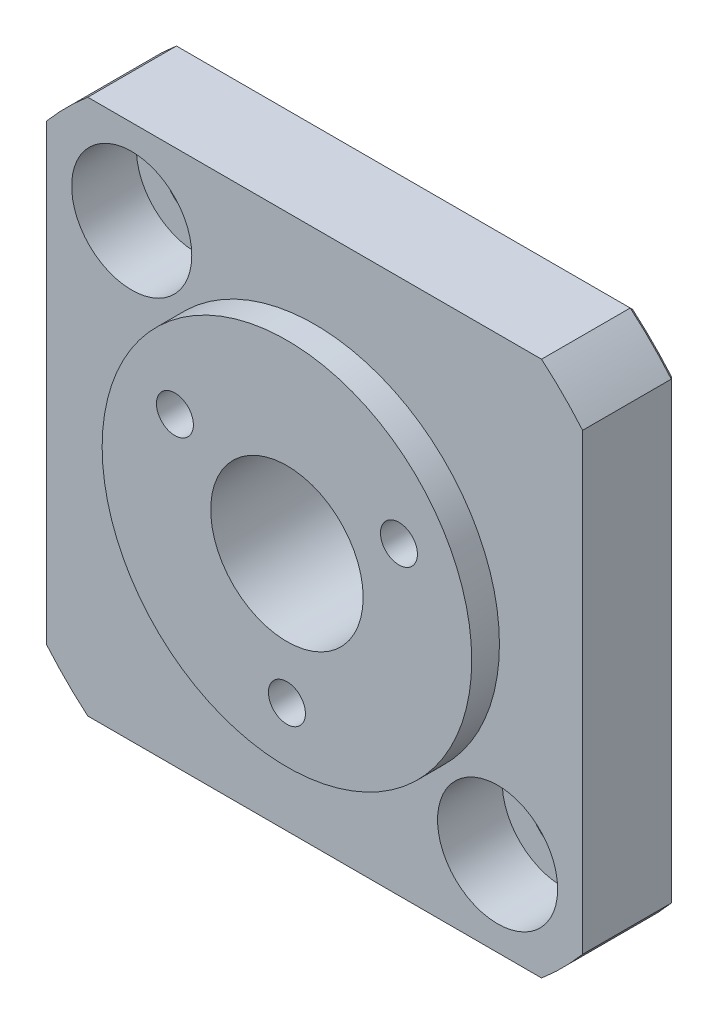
ISO-10303-21;
HEADER;
FILE_DESCRIPTION(('STEP AP214'),'2;1');
FILE_NAME('part.step','',(''),(''),'','','');
FILE_SCHEMA(('AUTOMOTIVE_DESIGN { 1 0 10303 214 1 1 1 1 }'));
ENDSEC;
DATA;
#1=APPLICATION_CONTEXT('core data for automotive mechanical design processes');
#2=APPLICATION_PROTOCOL_DEFINITION('international standard','automotive_design',2000,#1);
#3=PRODUCT_CONTEXT('',#1,'mechanical');
#4=PRODUCT('Part','Part','',(#3));
#5=PRODUCT_RELATED_PRODUCT_CATEGORY('part','',(#4));
#6=PRODUCT_DEFINITION_FORMATION('','',#4);
#7=PRODUCT_DEFINITION_CONTEXT('part definition',#1,'design');
#8=PRODUCT_DEFINITION('design','',#6,#7);
#9=PRODUCT_DEFINITION_SHAPE('','',#8);
#10=(LENGTH_UNIT() NAMED_UNIT(*) SI_UNIT(.MILLI.,.METRE.));
#11=(NAMED_UNIT(*) PLANE_ANGLE_UNIT() SI_UNIT($,.RADIAN.));
#12=(NAMED_UNIT(*) SI_UNIT($,.STERADIAN.) SOLID_ANGLE_UNIT());
#13=UNCERTAINTY_MEASURE_WITH_UNIT(LENGTH_MEASURE(1.E-05),#10,'distance_accuracy_value','');
#14=(GEOMETRIC_REPRESENTATION_CONTEXT(3) GLOBAL_UNCERTAINTY_ASSIGNED_CONTEXT((#13)) GLOBAL_UNIT_ASSIGNED_CONTEXT((#10,
#11,#12)) REPRESENTATION_CONTEXT('',''));
#15=CARTESIAN_POINT('',(0.,0.,0.));
#16=DIRECTION('',(0.,0.,1.));
#17=DIRECTION('',(1.,0.,0.));
#18=AXIS2_PLACEMENT_3D('',#15,#16,#17);
#19=CARTESIAN_POINT('',(9.9,-9.9,0.));
#20=DIRECTION('',(0.,0.,1.));
#21=DIRECTION('',(1.,0.,0.));
#22=AXIS2_PLACEMENT_3D('',#19,#20,#21);
#23=CYLINDRICAL_SURFACE('',#22,1.75);
#24=CARTESIAN_POINT('',(9.9,-9.9,0.));
#25=DIRECTION('',(0.,0.,1.));
#26=DIRECTION('',(1.,0.,0.));
#27=AXIS2_PLACEMENT_3D('',#24,#25,#26);
#28=CIRCLE('',#27,1.75);
#29=CARTESIAN_POINT('',(11.65,-9.9,0.));
#30=VERTEX_POINT('',#29);
#31=EDGE_CURVE('E608',#30,#30,#28,.T.);
#32=ORIENTED_EDGE('',*,*,#31,.F.);
#33=EDGE_LOOP('',(#32));
#34=FACE_BOUND('',#33,.T.);
#35=CARTESIAN_POINT('',(9.9,-9.9,1.5));
#36=DIRECTION('',(0.,0.,1.));
#37=DIRECTION('',(1.,0.,0.));
#38=AXIS2_PLACEMENT_3D('',#35,#36,#37);
#39=CIRCLE('',#38,1.75);
#40=CARTESIAN_POINT('',(11.65,-9.9,1.5));
#41=VERTEX_POINT('',#40);
#42=EDGE_CURVE('E356',#41,#41,#39,.F.);
#43=ORIENTED_EDGE('',*,*,#42,.F.);
#44=EDGE_LOOP('',(#43));
#45=FACE_BOUND('',#44,.T.);
#46=ADVANCED_FACE('F352',(#34,#45),#23,.F.);
#47=CARTESIAN_POINT('',(-9.9,9.9,0.));
#48=DIRECTION('',(0.,0.,1.));
#49=DIRECTION('',(1.,0.,0.));
#50=AXIS2_PLACEMENT_3D('',#47,#48,#49);
#51=CYLINDRICAL_SURFACE('',#50,1.75);
#52=CARTESIAN_POINT('',(-9.9,9.9,0.));
#53=DIRECTION('',(0.,0.,1.));
#54=DIRECTION('',(1.,0.,0.));
#55=AXIS2_PLACEMENT_3D('',#52,#53,#54);
#56=CIRCLE('',#55,1.75);
#57=CARTESIAN_POINT('',(-8.15,9.9,0.));
#58=VERTEX_POINT('',#57);
#59=EDGE_CURVE('E464',#58,#58,#56,.T.);
#60=ORIENTED_EDGE('',*,*,#59,.F.);
#61=EDGE_LOOP('',(#60));
#62=FACE_BOUND('',#61,.T.);
#63=CARTESIAN_POINT('',(-9.9,9.9,1.5));
#64=DIRECTION('',(0.,0.,1.));
#65=DIRECTION('',(1.,0.,0.));
#66=AXIS2_PLACEMENT_3D('',#63,#64,#65);
#67=CIRCLE('',#66,1.75);
#68=CARTESIAN_POINT('',(-8.15,9.9,1.5));
#69=VERTEX_POINT('',#68);
#70=EDGE_CURVE('E500',#69,#69,#67,.F.);
#71=ORIENTED_EDGE('',*,*,#70,.F.);
#72=EDGE_LOOP('',(#71));
#73=FACE_BOUND('',#72,.T.);
#74=ADVANCED_FACE('F687',(#62,#73),#51,.F.);
#75=CARTESIAN_POINT('',(0.,0.,5.));
#76=DIRECTION('',(0.,0.,1.));
#77=DIRECTION('',(1.,0.,0.));
#78=AXIS2_PLACEMENT_3D('',#75,#76,#77);
#79=PLANE('',#78);
#80=CARTESIAN_POINT('',(9.9,-9.9,5.));
#81=DIRECTION('',(0.,0.,1.));
#82=DIRECTION('',(1.,0.,0.));
#83=AXIS2_PLACEMENT_3D('',#80,#81,#82);
#84=CIRCLE('',#83,3.25);
#85=CARTESIAN_POINT('',(13.15,-9.9,5.));
#86=VERTEX_POINT('',#85);
#87=EDGE_CURVE('E880',#86,#86,#84,.T.);
#88=ORIENTED_EDGE('',*,*,#87,.F.);
#89=EDGE_LOOP('',(#88));
#90=FACE_BOUND('',#89,.T.);
#91=CARTESIAN_POINT('',(-9.9,9.9,5.));
#92=DIRECTION('',(0.,0.,1.));
#93=DIRECTION('',(1.,0.,0.));
#94=AXIS2_PLACEMENT_3D('',#91,#92,#93);
#95=CIRCLE('',#94,3.25);
#96=CARTESIAN_POINT('',(-6.65,9.9,5.));
#97=VERTEX_POINT('',#96);
#98=EDGE_CURVE('E509',#97,#97,#95,.T.);
#99=ORIENTED_EDGE('',*,*,#98,.F.);
#100=EDGE_LOOP('',(#99));
#101=FACE_BOUND('',#100,.T.);
#102=CARTESIAN_POINT('',(0.,0.,5.));
#103=DIRECTION('',(0.,0.,1.));
#104=DIRECTION('',(1.,0.,0.));
#105=AXIS2_PLACEMENT_3D('',#102,#103,#104);
#106=CIRCLE('',#105,19.);
#107=CARTESIAN_POINT('',(14.5,12.2780291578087,5.));
#108=VERTEX_POINT('',#107);
#109=CARTESIAN_POINT('',(12.2780291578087,14.5,5.));
#110=VERTEX_POINT('',#109);
#111=EDGE_CURVE('E456',#108,#110,#106,.T.);
#112=ORIENTED_EDGE('',*,*,#111,.T.);
#113=DIRECTION('',(-1.,0.,0.));
#114=VECTOR('',#113,1.);
#115=CARTESIAN_POINT('',(-12.2780291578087,14.5,5.));
#116=LINE('',#115,#114);
#117=CARTESIAN_POINT('',(-12.2780291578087,14.5,5.));
#118=VERTEX_POINT('',#117);
#119=EDGE_CURVE('E444',#110,#118,#116,.T.);
#120=ORIENTED_EDGE('',*,*,#119,.T.);
#121=CARTESIAN_POINT('',(0.,0.,5.));
#122=DIRECTION('',(0.,0.,1.));
#123=DIRECTION('',(1.,0.,0.));
#124=AXIS2_PLACEMENT_3D('',#121,#122,#123);
#125=CIRCLE('',#124,19.);
#126=CARTESIAN_POINT('',(-14.5,12.2780291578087,5.));
#127=VERTEX_POINT('',#126);
#128=EDGE_CURVE('E455',#118,#127,#125,.T.);
#129=ORIENTED_EDGE('',*,*,#128,.T.);
#130=DIRECTION('',(0.,-1.,0.));
#131=VECTOR('',#130,1.);
#132=CARTESIAN_POINT('',(-14.5,12.2780291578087,5.));
#133=LINE('',#132,#131);
#134=CARTESIAN_POINT('',(-14.5,-12.2780291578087,5.));
#135=VERTEX_POINT('',#134);
#136=EDGE_CURVE('E614',#127,#135,#133,.T.);
#137=ORIENTED_EDGE('',*,*,#136,.T.);
#138=CARTESIAN_POINT('',(0.,0.,5.));
#139=DIRECTION('',(0.,0.,1.));
#140=DIRECTION('',(1.,0.,0.));
#141=AXIS2_PLACEMENT_3D('',#138,#139,#140);
#142=CIRCLE('',#141,19.);
#143=CARTESIAN_POINT('',(-12.2780291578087,-14.5,5.));
#144=VERTEX_POINT('',#143);
#145=EDGE_CURVE('E616',#135,#144,#142,.T.);
#146=ORIENTED_EDGE('',*,*,#145,.T.);
#147=DIRECTION('',(1.,0.,0.));
#148=VECTOR('',#147,1.);
#149=CARTESIAN_POINT('',(-12.2780291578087,-14.5,5.));
#150=LINE('',#149,#148);
#151=CARTESIAN_POINT('',(12.2780291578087,-14.5,5.));
#152=VERTEX_POINT('',#151);
#153=EDGE_CURVE('E618',#144,#152,#150,.T.);
#154=ORIENTED_EDGE('',*,*,#153,.T.);
#155=CARTESIAN_POINT('',(0.,0.,5.));
#156=DIRECTION('',(0.,0.,1.));
#157=DIRECTION('',(1.,0.,0.));
#158=AXIS2_PLACEMENT_3D('',#155,#156,#157);
#159=CIRCLE('',#158,19.);
#160=CARTESIAN_POINT('',(14.5,-12.2780291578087,5.));
#161=VERTEX_POINT('',#160);
#162=EDGE_CURVE('E620',#152,#161,#159,.T.);
#163=ORIENTED_EDGE('',*,*,#162,.T.);
#164=DIRECTION('',(0.,1.,0.));
#165=VECTOR('',#164,1.);
#166=CARTESIAN_POINT('',(14.5,12.2780291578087,5.));
#167=LINE('',#166,#165);
#168=EDGE_CURVE('E462',#161,#108,#167,.T.);
#169=ORIENTED_EDGE('',*,*,#168,.T.);
#170=EDGE_LOOP('',(#112,#120,#129,#137,#146,#154,#163,#169));
#171=FACE_BOUND('',#170,.T.);
#172=CARTESIAN_POINT('',(0.,0.,5.));
#173=DIRECTION('',(0.,0.,1.));
#174=DIRECTION('',(1.,0.,0.));
#175=AXIS2_PLACEMENT_3D('',#172,#173,#174);
#176=CIRCLE('',#175,10.);
#177=CARTESIAN_POINT('',(10.,0.,5.));
#178=VERTEX_POINT('',#177);
#179=EDGE_CURVE('E602',#178,#178,#176,.T.);
#180=ORIENTED_EDGE('',*,*,#179,.F.);
#181=EDGE_LOOP('',(#180));
#182=FACE_BOUND('',#181,.T.);
#183=ADVANCED_FACE('F459',(#90,#101,#171,#182),#79,.T.);
#184=CARTESIAN_POINT('',(0.,0.,5.));
#185=DIRECTION('',(0.,0.,-1.));
#186=DIRECTION('',(-1.,0.,0.));
#187=AXIS2_PLACEMENT_3D('',#184,#185,#186);
#188=CYLINDRICAL_SURFACE('',#187,19.);
#189=DIRECTION('',(0.,0.,-1.));
#190=VECTOR('',#189,1.);
#191=CARTESIAN_POINT('',(14.5,12.2780291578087,5.));
#192=LINE('',#191,#190);
#193=CARTESIAN_POINT('',(14.5,12.2780291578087,0.200000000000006));
#194=VERTEX_POINT('',#193);
#195=EDGE_CURVE('E623',#108,#194,#192,.T.);
#196=ORIENTED_EDGE('',*,*,#195,.T.);
#197=CARTESIAN_POINT('',(0.,0.,0.200000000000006));
#198=DIRECTION('',(0.,0.,1.));
#199=DIRECTION('',(1.,0.,0.));
#200=AXIS2_PLACEMENT_3D('',#197,#198,#199);
#201=CIRCLE('',#200,19.);
#202=CARTESIAN_POINT('',(12.2780291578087,14.5,0.200000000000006));
#203=VERTEX_POINT('',#202);
#204=EDGE_CURVE('E11',#194,#203,#201,.T.);
#205=ORIENTED_EDGE('',*,*,#204,.T.);
#206=DIRECTION('',(0.,0.,-1.));
#207=VECTOR('',#206,1.);
#208=CARTESIAN_POINT('',(12.2780291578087,14.5,5.));
#209=LINE('',#208,#207);
#210=EDGE_CURVE('E449',#110,#203,#209,.T.);
#211=ORIENTED_EDGE('',*,*,#210,.F.);
#212=ORIENTED_EDGE('',*,*,#111,.F.);
#213=EDGE_LOOP('',(#196,#205,#211,#212));
#214=FACE_BOUND('',#213,.T.);
#215=ADVANCED_FACE('F354',(#214),#188,.T.);
#216=CARTESIAN_POINT('',(-12.2780291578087,14.5,5.));
#217=DIRECTION('',(0.,-1.,0.));
#218=DIRECTION('',(0.,0.,-1.));
#219=AXIS2_PLACEMENT_3D('',#216,#217,#218);
#220=PLANE('',#219);
#221=ORIENTED_EDGE('',*,*,#210,.T.);
#222=DIRECTION('',(-1.,0.,0.));
#223=VECTOR('',#222,1.);
#224=CARTESIAN_POINT('',(-12.2780291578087,14.5,0.200000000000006));
#225=LINE('',#224,#223);
#226=CARTESIAN_POINT('',(-12.2780291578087,14.5,0.200000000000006));
#227=VERTEX_POINT('',#226);
#228=EDGE_CURVE('E467',#203,#227,#225,.T.);
#229=ORIENTED_EDGE('',*,*,#228,.T.);
#230=DIRECTION('',(0.,0.,-1.));
#231=VECTOR('',#230,1.);
#232=CARTESIAN_POINT('',(-12.2780291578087,14.5,5.));
#233=LINE('',#232,#231);
#234=EDGE_CURVE('E452',#118,#227,#233,.T.);
#235=ORIENTED_EDGE('',*,*,#234,.F.);
#236=ORIENTED_EDGE('',*,*,#119,.F.);
#237=EDGE_LOOP('',(#221,#229,#235,#236));
#238=FACE_BOUND('',#237,.T.);
#239=ADVANCED_FACE('F446',(#238),#220,.F.);
#240=CARTESIAN_POINT('',(0.,0.,5.));
#241=DIRECTION('',(0.,0.,-1.));
#242=DIRECTION('',(-1.,0.,0.));
#243=AXIS2_PLACEMENT_3D('',#240,#241,#242);
#244=CYLINDRICAL_SURFACE('',#243,19.);
#245=ORIENTED_EDGE('',*,*,#234,.T.);
#246=CARTESIAN_POINT('',(0.,0.,0.200000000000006));
#247=DIRECTION('',(0.,0.,1.));
#248=DIRECTION('',(1.,0.,0.));
#249=AXIS2_PLACEMENT_3D('',#246,#247,#248);
#250=CIRCLE('',#249,19.);
#251=CARTESIAN_POINT('',(-14.5,12.2780291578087,0.200000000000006));
#252=VERTEX_POINT('',#251);
#253=EDGE_CURVE('E491',#227,#252,#250,.T.);
#254=ORIENTED_EDGE('',*,*,#253,.T.);
#255=DIRECTION('',(0.,0.,-1.));
#256=VECTOR('',#255,1.);
#257=CARTESIAN_POINT('',(-14.5,12.2780291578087,5.));
#258=LINE('',#257,#256);
#259=EDGE_CURVE('E471',#127,#252,#258,.T.);
#260=ORIENTED_EDGE('',*,*,#259,.F.);
#261=ORIENTED_EDGE('',*,*,#128,.F.);
#262=EDGE_LOOP('',(#245,#254,#260,#261));
#263=FACE_BOUND('',#262,.T.);
#264=ADVANCED_FACE('F718',(#263),#244,.T.);
#265=CARTESIAN_POINT('',(-14.5,12.2780291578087,5.));
#266=DIRECTION('',(1.,0.,0.));
#267=DIRECTION('',(0.,1.,0.));
#268=AXIS2_PLACEMENT_3D('',#265,#266,#267);
#269=PLANE('',#268);
#270=ORIENTED_EDGE('',*,*,#259,.T.);
#271=DIRECTION('',(0.,-1.,0.));
#272=VECTOR('',#271,1.);
#273=CARTESIAN_POINT('',(-14.5,12.2780291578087,0.200000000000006));
#274=LINE('',#273,#272);
#275=CARTESIAN_POINT('',(-14.5,-12.2780291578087,0.200000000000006));
#276=VERTEX_POINT('',#275);
#277=EDGE_CURVE('E493',#252,#276,#274,.T.);
#278=ORIENTED_EDGE('',*,*,#277,.T.);
#279=DIRECTION('',(0.,0.,-1.));
#280=VECTOR('',#279,1.);
#281=CARTESIAN_POINT('',(-14.5,-12.2780291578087,5.));
#282=LINE('',#281,#280);
#283=EDGE_CURVE('E632',#135,#276,#282,.T.);
#284=ORIENTED_EDGE('',*,*,#283,.F.);
#285=ORIENTED_EDGE('',*,*,#136,.F.);
#286=EDGE_LOOP('',(#270,#278,#284,#285));
#287=FACE_BOUND('',#286,.T.);
#288=ADVANCED_FACE('F639',(#287),#269,.F.);
#289=CARTESIAN_POINT('',(0.,0.,5.));
#290=DIRECTION('',(0.,0.,-1.));
#291=DIRECTION('',(-1.,0.,0.));
#292=AXIS2_PLACEMENT_3D('',#289,#290,#291);
#293=CYLINDRICAL_SURFACE('',#292,19.);
#294=ORIENTED_EDGE('',*,*,#283,.T.);
#295=CARTESIAN_POINT('',(0.,0.,0.200000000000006));
#296=DIRECTION('',(0.,0.,1.));
#297=DIRECTION('',(1.,0.,0.));
#298=AXIS2_PLACEMENT_3D('',#295,#296,#297);
#299=CIRCLE('',#298,19.);
#300=CARTESIAN_POINT('',(-12.2780291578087,-14.5,0.200000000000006));
#301=VERTEX_POINT('',#300);
#302=EDGE_CURVE('E495',#276,#301,#299,.T.);
#303=ORIENTED_EDGE('',*,*,#302,.T.);
#304=DIRECTION('',(0.,0.,-1.));
#305=VECTOR('',#304,1.);
#306=CARTESIAN_POINT('',(-12.2780291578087,-14.5,5.));
#307=LINE('',#306,#305);
#308=EDGE_CURVE('E629',#144,#301,#307,.T.);
#309=ORIENTED_EDGE('',*,*,#308,.F.);
#310=ORIENTED_EDGE('',*,*,#145,.F.);
#311=EDGE_LOOP('',(#294,#303,#309,#310));
#312=FACE_BOUND('',#311,.T.);
#313=ADVANCED_FACE('F668',(#312),#293,.T.);
#314=CARTESIAN_POINT('',(-12.2780291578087,-14.5,5.));
#315=DIRECTION('',(0.,1.,0.));
#316=DIRECTION('',(0.,0.,1.));
#317=AXIS2_PLACEMENT_3D('',#314,#315,#316);
#318=PLANE('',#317);
#319=ORIENTED_EDGE('',*,*,#308,.T.);
#320=DIRECTION('',(1.,0.,0.));
#321=VECTOR('',#320,1.);
#322=CARTESIAN_POINT('',(-12.2780291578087,-14.5,0.200000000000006));
#323=LINE('',#322,#321);
#324=CARTESIAN_POINT('',(12.2780291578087,-14.5,0.200000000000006));
#325=VERTEX_POINT('',#324);
#326=EDGE_CURVE('E497',#301,#325,#323,.T.);
#327=ORIENTED_EDGE('',*,*,#326,.T.);
#328=DIRECTION('',(0.,0.,-1.));
#329=VECTOR('',#328,1.);
#330=CARTESIAN_POINT('',(12.2780291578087,-14.5,5.));
#331=LINE('',#330,#329);
#332=EDGE_CURVE('E627',#152,#325,#331,.T.);
#333=ORIENTED_EDGE('',*,*,#332,.F.);
#334=ORIENTED_EDGE('',*,*,#153,.F.);
#335=EDGE_LOOP('',(#319,#327,#333,#334));
#336=FACE_BOUND('',#335,.T.);
#337=ADVANCED_FACE('F673',(#336),#318,.F.);
#338=CARTESIAN_POINT('',(0.,0.,5.));
#339=DIRECTION('',(0.,0.,-1.));
#340=DIRECTION('',(-1.,0.,0.));
#341=AXIS2_PLACEMENT_3D('',#338,#339,#340);
#342=CYLINDRICAL_SURFACE('',#341,19.);
#343=ORIENTED_EDGE('',*,*,#332,.T.);
#344=CARTESIAN_POINT('',(0.,0.,0.200000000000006));
#345=DIRECTION('',(0.,0.,1.));
#346=DIRECTION('',(1.,0.,0.));
#347=AXIS2_PLACEMENT_3D('',#344,#345,#346);
#348=CIRCLE('',#347,19.);
#349=CARTESIAN_POINT('',(14.5,-12.2780291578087,0.200000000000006));
#350=VERTEX_POINT('',#349);
#351=EDGE_CURVE('E376',#325,#350,#348,.T.);
#352=ORIENTED_EDGE('',*,*,#351,.T.);
#353=DIRECTION('',(0.,0.,-1.));
#354=VECTOR('',#353,1.);
#355=CARTESIAN_POINT('',(14.5,-12.2780291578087,5.));
#356=LINE('',#355,#354);
#357=EDGE_CURVE('E625',#161,#350,#356,.T.);
#358=ORIENTED_EDGE('',*,*,#357,.F.);
#359=ORIENTED_EDGE('',*,*,#162,.F.);
#360=EDGE_LOOP('',(#343,#352,#358,#359));
#361=FACE_BOUND('',#360,.T.);
#362=ADVANCED_FACE('F709',(#361),#342,.T.);
#363=CARTESIAN_POINT('',(14.5,12.2780291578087,5.));
#364=DIRECTION('',(-1.,0.,0.));
#365=DIRECTION('',(0.,-1.,0.));
#366=AXIS2_PLACEMENT_3D('',#363,#364,#365);
#367=PLANE('',#366);
#368=ORIENTED_EDGE('',*,*,#357,.T.);
#369=DIRECTION('',(0.,1.,0.));
#370=VECTOR('',#369,1.);
#371=CARTESIAN_POINT('',(14.5,12.2780291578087,0.200000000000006));
#372=LINE('',#371,#370);
#373=EDGE_CURVE('E361',#350,#194,#372,.T.);
#374=ORIENTED_EDGE('',*,*,#373,.T.);
#375=ORIENTED_EDGE('',*,*,#195,.F.);
#376=ORIENTED_EDGE('',*,*,#168,.F.);
#377=EDGE_LOOP('',(#368,#374,#375,#376));
#378=FACE_BOUND('',#377,.T.);
#379=ADVANCED_FACE('F703',(#378),#367,.F.);
#380=CARTESIAN_POINT('',(0.,0.,0.));
#381=DIRECTION('',(0.,0.,1.));
#382=DIRECTION('',(1.,0.,0.));
#383=AXIS2_PLACEMENT_3D('',#380,#381,#382);
#384=PLANE('',#383);
#385=CARTESIAN_POINT('',(0.,0.,0.));
#386=DIRECTION('',(0.,0.,1.));
#387=DIRECTION('',(1.,0.,0.));
#388=AXIS2_PLACEMENT_3D('',#385,#386,#387);
#389=CIRCLE('',#388,18.8);
#390=CARTESIAN_POINT('',(-14.3,12.2045073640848,0.));
#391=VERTEX_POINT('',#390);
#392=CARTESIAN_POINT('',(-12.2045073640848,14.3,0.));
#393=VERTEX_POINT('',#392);
#394=EDGE_CURVE('E486',#391,#393,#389,.F.);
#395=ORIENTED_EDGE('',*,*,#394,.T.);
#396=DIRECTION('',(1.,0.,0.));
#397=VECTOR('',#396,1.);
#398=CARTESIAN_POINT('',(0.,14.3,0.));
#399=LINE('',#398,#397);
#400=CARTESIAN_POINT('',(12.2045073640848,14.3,0.));
#401=VERTEX_POINT('',#400);
#402=EDGE_CURVE('E488',#393,#401,#399,.T.);
#403=ORIENTED_EDGE('',*,*,#402,.T.);
#404=CARTESIAN_POINT('',(0.,0.,0.));
#405=DIRECTION('',(0.,0.,1.));
#406=DIRECTION('',(1.,0.,0.));
#407=AXIS2_PLACEMENT_3D('',#404,#405,#406);
#408=CIRCLE('',#407,18.8);
#409=CARTESIAN_POINT('',(14.3,12.2045073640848,0.));
#410=VERTEX_POINT('',#409);
#411=EDGE_CURVE('E469',#401,#410,#408,.F.);
#412=ORIENTED_EDGE('',*,*,#411,.T.);
#413=DIRECTION('',(0.,-1.,0.));
#414=VECTOR('',#413,1.);
#415=CARTESIAN_POINT('',(14.3,0.,0.));
#416=LINE('',#415,#414);
#417=CARTESIAN_POINT('',(14.3,-12.2045073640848,0.));
#418=VERTEX_POINT('',#417);
#419=EDGE_CURVE('E476',#410,#418,#416,.T.);
#420=ORIENTED_EDGE('',*,*,#419,.T.);
#421=CARTESIAN_POINT('',(0.,0.,0.));
#422=DIRECTION('',(0.,0.,1.));
#423=DIRECTION('',(1.,0.,0.));
#424=AXIS2_PLACEMENT_3D('',#421,#422,#423);
#425=CIRCLE('',#424,18.8);
#426=CARTESIAN_POINT('',(12.2045073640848,-14.3,0.));
#427=VERTEX_POINT('',#426);
#428=EDGE_CURVE('E478',#418,#427,#425,.F.);
#429=ORIENTED_EDGE('',*,*,#428,.T.);
#430=DIRECTION('',(-1.,0.,0.));
#431=VECTOR('',#430,1.);
#432=CARTESIAN_POINT('',(0.,-14.3,0.));
#433=LINE('',#432,#431);
#434=CARTESIAN_POINT('',(-12.2045073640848,-14.3,0.));
#435=VERTEX_POINT('',#434);
#436=EDGE_CURVE('E480',#427,#435,#433,.T.);
#437=ORIENTED_EDGE('',*,*,#436,.T.);
#438=CARTESIAN_POINT('',(0.,0.,0.));
#439=DIRECTION('',(0.,0.,1.));
#440=DIRECTION('',(1.,0.,0.));
#441=AXIS2_PLACEMENT_3D('',#438,#439,#440);
#442=CIRCLE('',#441,18.8);
#443=CARTESIAN_POINT('',(-14.3,-12.2045073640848,0.));
#444=VERTEX_POINT('',#443);
#445=EDGE_CURVE('E482',#435,#444,#442,.F.);
#446=ORIENTED_EDGE('',*,*,#445,.T.);
#447=DIRECTION('',(0.,1.,0.));
#448=VECTOR('',#447,1.);
#449=CARTESIAN_POINT('',(-14.3,0.,0.));
#450=LINE('',#449,#448);
#451=EDGE_CURVE('E484',#444,#391,#450,.T.);
#452=ORIENTED_EDGE('',*,*,#451,.T.);
#453=EDGE_LOOP('',(#395,#403,#412,#420,#429,#437,#446,#452));
#454=FACE_BOUND('',#453,.T.);
#455=CARTESIAN_POINT('',(0.,0.,0.));
#456=DIRECTION('',(0.,0.,1.));
#457=DIRECTION('',(1.,0.,0.));
#458=AXIS2_PLACEMENT_3D('',#455,#456,#457);
#459=CIRCLE('',#458,4.125);
#460=CARTESIAN_POINT('',(4.125,0.,0.));
#461=VERTEX_POINT('',#460);
#462=EDGE_CURVE('E599',#461,#461,#459,.T.);
#463=ORIENTED_EDGE('',*,*,#462,.T.);
#464=EDGE_LOOP('',(#463));
#465=FACE_BOUND('',#464,.T.);
#466=ORIENTED_EDGE('',*,*,#31,.T.);
#467=EDGE_LOOP('',(#466));
#468=FACE_BOUND('',#467,.T.);
#469=ORIENTED_EDGE('',*,*,#59,.T.);
#470=EDGE_LOOP('',(#469));
#471=FACE_BOUND('',#470,.T.);
#472=ADVANCED_FACE('F658',(#454,#465,#468,#471),#384,.F.);
#473=CARTESIAN_POINT('',(0.,0.,6.50000000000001));
#474=DIRECTION('',(0.,0.,-1.));
#475=DIRECTION('',(-1.,0.,0.));
#476=AXIS2_PLACEMENT_3D('',#473,#474,#475);
#477=CYLINDRICAL_SURFACE('',#476,10.);
#478=CARTESIAN_POINT('',(0.,0.,6.50000000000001));
#479=DIRECTION('',(0.,0.,1.));
#480=DIRECTION('',(1.,0.,0.));
#481=AXIS2_PLACEMENT_3D('',#478,#479,#480);
#482=CIRCLE('',#481,10.);
#483=CARTESIAN_POINT('',(10.,0.,6.50000000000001));
#484=VERTEX_POINT('',#483);
#485=EDGE_CURVE('E605',#484,#484,#482,.T.);
#486=ORIENTED_EDGE('',*,*,#485,.F.);
#487=EDGE_LOOP('',(#486));
#488=FACE_BOUND('',#487,.T.);
#489=ORIENTED_EDGE('',*,*,#179,.T.);
#490=EDGE_LOOP('',(#489));
#491=FACE_BOUND('',#490,.T.);
#492=ADVANCED_FACE('F698',(#488,#491),#477,.T.);
#493=CARTESIAN_POINT('',(0.,0.,6.50000000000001));
#494=DIRECTION('',(0.,0.,1.));
#495=DIRECTION('',(1.,0.,0.));
#496=AXIS2_PLACEMENT_3D('',#493,#494,#495);
#497=PLANE('',#496);
#498=CARTESIAN_POINT('',(0.,-7.,6.50000000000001));
#499=DIRECTION('',(0.,0.,1.));
#500=DIRECTION('',(1.,0.,0.));
#501=AXIS2_PLACEMENT_3D('',#498,#499,#500);
#502=CIRCLE('',#501,0.999999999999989);
#503=CARTESIAN_POINT('',(1.00000000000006,-7.,6.50000000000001));
#504=VERTEX_POINT('',#503);
#505=EDGE_CURVE('E864',#504,#504,#502,.T.);
#506=ORIENTED_EDGE('',*,*,#505,.F.);
#507=EDGE_LOOP('',(#506));
#508=FACE_BOUND('',#507,.T.);
#509=CARTESIAN_POINT('',(-6.06217782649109,3.49999999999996,6.50000000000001));
#510=DIRECTION('',(0.,0.,1.));
#511=DIRECTION('',(1.,0.,0.));
#512=AXIS2_PLACEMENT_3D('',#509,#510,#511);
#513=CIRCLE('',#512,0.999999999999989);
#514=CARTESIAN_POINT('',(-5.0621778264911,3.49999999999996,6.50000000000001));
#515=VERTEX_POINT('',#514);
#516=EDGE_CURVE('E863',#515,#515,#513,.T.);
#517=ORIENTED_EDGE('',*,*,#516,.F.);
#518=EDGE_LOOP('',(#517));
#519=FACE_BOUND('',#518,.T.);
#520=CARTESIAN_POINT('',(6.06217782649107,3.50000000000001,6.50000000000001));
#521=DIRECTION('',(0.,0.,1.));
#522=DIRECTION('',(1.,0.,0.));
#523=AXIS2_PLACEMENT_3D('',#520,#521,#522);
#524=CIRCLE('',#523,0.999999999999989);
#525=CARTESIAN_POINT('',(7.06217782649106,3.50000000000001,6.50000000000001));
#526=VERTEX_POINT('',#525);
#527=EDGE_CURVE('E874',#526,#526,#524,.T.);
#528=ORIENTED_EDGE('',*,*,#527,.F.);
#529=EDGE_LOOP('',(#528));
#530=FACE_BOUND('',#529,.T.);
#531=CARTESIAN_POINT('',(0.,0.,6.50000000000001));
#532=DIRECTION('',(0.,0.,1.));
#533=DIRECTION('',(1.,0.,0.));
#534=AXIS2_PLACEMENT_3D('',#531,#532,#533);
#535=CIRCLE('',#534,4.125);
#536=CARTESIAN_POINT('',(4.125,0.,6.50000000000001));
#537=VERTEX_POINT('',#536);
#538=EDGE_CURVE('E596',#537,#537,#535,.T.);
#539=ORIENTED_EDGE('',*,*,#538,.F.);
#540=EDGE_LOOP('',(#539));
#541=FACE_BOUND('',#540,.T.);
#542=ORIENTED_EDGE('',*,*,#485,.T.);
#543=EDGE_LOOP('',(#542));
#544=FACE_BOUND('',#543,.T.);
#545=ADVANCED_FACE('F684',(#508,#519,#530,#541,#544),#497,.T.);
#546=CARTESIAN_POINT('',(0.,0.,0.));
#547=DIRECTION('',(0.,0.,1.));
#548=DIRECTION('',(1.,0.,0.));
#549=AXIS2_PLACEMENT_3D('',#546,#547,#548);
#550=CYLINDRICAL_SURFACE('',#549,4.125);
#551=ORIENTED_EDGE('',*,*,#462,.F.);
#552=EDGE_LOOP('',(#551));
#553=FACE_BOUND('',#552,.T.);
#554=ORIENTED_EDGE('',*,*,#538,.T.);
#555=EDGE_LOOP('',(#554));
#556=FACE_BOUND('',#555,.T.);
#557=ADVANCED_FACE('F680',(#553,#556),#550,.F.);
#558=CARTESIAN_POINT('',(-12.2780291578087,-14.5,0.200000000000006));
#559=DIRECTION('',(0.,0.707106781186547,0.707106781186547));
#560=DIRECTION('',(0.,-0.707106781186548,0.707106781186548));
#561=AXIS2_PLACEMENT_3D('',#558,#559,#560);
#562=PLANE('',#561);
#563=CARTESIAN_POINT('',(-12.2780291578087,-14.5,0.200000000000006));
#564=CARTESIAN_POINT('',(-12.2658099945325,-14.466660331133,0.16666033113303));
#565=CARTESIAN_POINT('',(-12.253573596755,-14.4333238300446,0.13332383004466));
#566=CARTESIAN_POINT('',(-12.2290663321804,-14.366657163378,0.066657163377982));
#567=CARTESIAN_POINT('',(-12.2167954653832,-14.3333269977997,0.0333269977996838));
#568=CARTESIAN_POINT('',(-12.2045073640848,-14.3,0.));
#569=B_SPLINE_CURVE_WITH_KNOTS('',3,(#563,#564,#565,#566,#567,#568),.UNSPECIFIED.,.F.,.F.,(4,2,
4),(0.,0.146121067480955,0.292242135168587),.UNSPECIFIED.);
#570=EDGE_CURVE('E576',#435,#301,#569,.F.);
#571=ORIENTED_EDGE('',*,*,#570,.F.);
#572=ORIENTED_EDGE('',*,*,#436,.F.);
#573=CARTESIAN_POINT('',(12.2780291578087,-14.5,0.200000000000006));
#574=CARTESIAN_POINT('',(12.2658099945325,-14.466660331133,0.16666033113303));
#575=CARTESIAN_POINT('',(12.253573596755,-14.4333238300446,0.13332383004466));
#576=CARTESIAN_POINT('',(12.2290663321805,-14.366657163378,0.0666571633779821));
#577=CARTESIAN_POINT('',(12.2167954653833,-14.3333269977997,0.033326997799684));
#578=CARTESIAN_POINT('',(12.2045073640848,-14.3,0.));
#579=B_SPLINE_CURVE_WITH_KNOTS('',3,(#573,#574,#575,#576,#577,#578),.UNSPECIFIED.,.F.,.F.,(4,2,
4),(0.,0.146121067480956,0.292242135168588),.UNSPECIFIED.);
#580=EDGE_CURVE('E590',#325,#427,#579,.T.);
#581=ORIENTED_EDGE('',*,*,#580,.F.);
#582=ORIENTED_EDGE('',*,*,#326,.F.);
#583=EDGE_LOOP('',(#571,#572,#581,#582));
#584=FACE_BOUND('',#583,.T.);
#585=ADVANCED_FACE('F585',(#584),#562,.F.);
#586=CARTESIAN_POINT('',(0.,0.,0.200000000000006));
#587=DIRECTION('',(0.,0.,1.));
#588=DIRECTION('',(1.,0.,0.));
#589=AXIS2_PLACEMENT_3D('',#586,#587,#588);
#590=CONICAL_SURFACE('',#589,19.,0.785398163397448);
#591=ORIENTED_EDGE('',*,*,#580,.T.);
#592=ORIENTED_EDGE('',*,*,#428,.F.);
#593=CARTESIAN_POINT('',(14.5,-12.2780291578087,0.200000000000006));
#594=CARTESIAN_POINT('',(14.466660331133,-12.2658099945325,0.166660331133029));
#595=CARTESIAN_POINT('',(14.4333238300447,-12.253573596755,0.133323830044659));
#596=CARTESIAN_POINT('',(14.366657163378,-12.2290663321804,0.0666571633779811));
#597=CARTESIAN_POINT('',(14.3333269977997,-12.2167954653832,0.0333269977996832));
#598=CARTESIAN_POINT('',(14.3,-12.2045073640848,0.));
#599=B_SPLINE_CURVE_WITH_KNOTS('',3,(#593,#594,#595,#596,#597,#598),.UNSPECIFIED.,.F.,.F.,(4,2,
4),(0.,0.146121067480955,0.292242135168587),.UNSPECIFIED.);
#600=EDGE_CURVE('E570',#350,#418,#599,.T.);
#601=ORIENTED_EDGE('',*,*,#600,.F.);
#602=ORIENTED_EDGE('',*,*,#351,.F.);
#603=EDGE_LOOP('',(#591,#592,#601,#602));
#604=FACE_BOUND('',#603,.T.);
#605=ADVANCED_FACE('F582',(#604),#590,.T.);
#606=CARTESIAN_POINT('',(0.,0.,0.200000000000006));
#607=DIRECTION('',(0.,0.,1.));
#608=DIRECTION('',(1.,0.,0.));
#609=AXIS2_PLACEMENT_3D('',#606,#607,#608);
#610=CONICAL_SURFACE('',#609,19.,0.785398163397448);
#611=ORIENTED_EDGE('',*,*,#570,.T.);
#612=ORIENTED_EDGE('',*,*,#302,.F.);
#613=CARTESIAN_POINT('',(-14.5,-12.2780291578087,0.200000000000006));
#614=CARTESIAN_POINT('',(-14.466660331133,-12.2658099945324,0.16666033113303));
#615=CARTESIAN_POINT('',(-14.4333238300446,-12.253573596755,0.13332383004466));
#616=CARTESIAN_POINT('',(-14.366657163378,-12.2290663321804,0.0666571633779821));
#617=CARTESIAN_POINT('',(-14.3333269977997,-12.2167954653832,0.0333269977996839));
#618=CARTESIAN_POINT('',(-14.3,-12.2045073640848,0.));
#619=B_SPLINE_CURVE_WITH_KNOTS('',3,(#613,#614,#615,#616,#617,#618),.UNSPECIFIED.,.F.,.F.,(4,2,
4),(0.,0.146121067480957,0.29224213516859),.UNSPECIFIED.);
#620=EDGE_CURVE('E552',#444,#276,#619,.F.);
#621=ORIENTED_EDGE('',*,*,#620,.F.);
#622=ORIENTED_EDGE('',*,*,#445,.F.);
#623=EDGE_LOOP('',(#611,#612,#621,#622));
#624=FACE_BOUND('',#623,.T.);
#625=ADVANCED_FACE('F565',(#624),#610,.T.);
#626=CARTESIAN_POINT('',(14.5,12.2780291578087,0.200000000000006));
#627=DIRECTION('',(-0.707106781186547,0.,0.707106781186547));
#628=DIRECTION('',(0.707106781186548,0.,0.707106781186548));
#629=AXIS2_PLACEMENT_3D('',#626,#627,#628);
#630=PLANE('',#629);
#631=ORIENTED_EDGE('',*,*,#600,.T.);
#632=ORIENTED_EDGE('',*,*,#419,.F.);
#633=CARTESIAN_POINT('',(14.5,12.2780291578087,0.200000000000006));
#634=CARTESIAN_POINT('',(14.466660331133,12.2658099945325,0.16666033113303));
#635=CARTESIAN_POINT('',(14.4333238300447,12.253573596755,0.13332383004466));
#636=CARTESIAN_POINT('',(14.366657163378,12.2290663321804,0.0666571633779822));
#637=CARTESIAN_POINT('',(14.3333269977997,12.2167954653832,0.033326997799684));
#638=CARTESIAN_POINT('',(14.3,12.2045073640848,0.));
#639=B_SPLINE_CURVE_WITH_KNOTS('',3,(#633,#634,#635,#636,#637,#638),.UNSPECIFIED.,.F.,.F.,(4,2,
4),(0.,0.146121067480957,0.29224213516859),.UNSPECIFIED.);
#640=EDGE_CURVE('E546',#194,#410,#639,.T.);
#641=ORIENTED_EDGE('',*,*,#640,.F.);
#642=ORIENTED_EDGE('',*,*,#373,.F.);
#643=EDGE_LOOP('',(#631,#632,#641,#642));
#644=FACE_BOUND('',#643,.T.);
#645=ADVANCED_FACE('F562',(#644),#630,.F.);
#646=CARTESIAN_POINT('',(-14.5,12.2780291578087,0.200000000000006));
#647=DIRECTION('',(0.707106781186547,0.,0.707106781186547));
#648=DIRECTION('',(0.707106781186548,0.,-0.707106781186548));
#649=AXIS2_PLACEMENT_3D('',#646,#647,#648);
#650=PLANE('',#649);
#651=ORIENTED_EDGE('',*,*,#620,.T.);
#652=ORIENTED_EDGE('',*,*,#277,.F.);
#653=CARTESIAN_POINT('',(-14.5,12.2780291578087,0.200000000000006));
#654=CARTESIAN_POINT('',(-14.466660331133,12.2658099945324,0.16666033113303));
#655=CARTESIAN_POINT('',(-14.4333238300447,12.253573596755,0.13332383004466));
#656=CARTESIAN_POINT('',(-14.366657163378,12.2290663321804,0.0666571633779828));
#657=CARTESIAN_POINT('',(-14.3333269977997,12.2167954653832,0.0333269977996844));
#658=CARTESIAN_POINT('',(-14.3,12.2045073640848,0.));
#659=B_SPLINE_CURVE_WITH_KNOTS('',3,(#653,#654,#655,#656,#657,#658),.UNSPECIFIED.,.F.,.F.,(4,2,
4),(0.,0.146121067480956,0.29224213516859),.UNSPECIFIED.);
#660=EDGE_CURVE('E553',#391,#252,#659,.F.);
#661=ORIENTED_EDGE('',*,*,#660,.F.);
#662=ORIENTED_EDGE('',*,*,#451,.F.);
#663=EDGE_LOOP('',(#651,#652,#661,#662));
#664=FACE_BOUND('',#663,.T.);
#665=ADVANCED_FACE('F540',(#664),#650,.F.);
#666=CARTESIAN_POINT('',(0.,0.,0.200000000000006));
#667=DIRECTION('',(0.,0.,1.));
#668=DIRECTION('',(1.,0.,0.));
#669=AXIS2_PLACEMENT_3D('',#666,#667,#668);
#670=CONICAL_SURFACE('',#669,19.,0.785398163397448);
#671=ORIENTED_EDGE('',*,*,#640,.T.);
#672=ORIENTED_EDGE('',*,*,#411,.F.);
#673=CARTESIAN_POINT('',(12.2045073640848,14.3,0.));
#674=CARTESIAN_POINT('',(12.2167954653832,14.3333269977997,0.0333269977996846));
#675=CARTESIAN_POINT('',(12.2290663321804,14.366657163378,0.0666571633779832));
#676=CARTESIAN_POINT('',(12.253573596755,14.4333238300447,0.133323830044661));
#677=CARTESIAN_POINT('',(12.2658099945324,14.466660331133,0.166660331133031));
#678=CARTESIAN_POINT('',(12.2780291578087,14.5,0.200000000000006));
#679=B_SPLINE_CURVE_WITH_KNOTS('',3,(#673,#674,#675,#676,#677,#678),.UNSPECIFIED.,.F.,.F.,(4,2,
4),(0.,0.146121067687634,0.29224213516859),.UNSPECIFIED.);
#680=EDGE_CURVE('E506',#203,#401,#679,.F.);
#681=ORIENTED_EDGE('',*,*,#680,.F.);
#682=ORIENTED_EDGE('',*,*,#204,.F.);
#683=EDGE_LOOP('',(#671,#672,#681,#682));
#684=FACE_BOUND('',#683,.T.);
#685=ADVANCED_FACE('F535',(#684),#670,.T.);
#686=CARTESIAN_POINT('',(0.,0.,0.200000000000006));
#687=DIRECTION('',(0.,0.,1.));
#688=DIRECTION('',(1.,0.,0.));
#689=AXIS2_PLACEMENT_3D('',#686,#687,#688);
#690=CONICAL_SURFACE('',#689,19.,0.785398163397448);
#691=ORIENTED_EDGE('',*,*,#660,.T.);
#692=ORIENTED_EDGE('',*,*,#253,.F.);
#693=CARTESIAN_POINT('',(-12.2780291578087,14.5,0.200000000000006));
#694=CARTESIAN_POINT('',(-12.2658099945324,14.466660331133,0.166660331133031));
#695=CARTESIAN_POINT('',(-12.253573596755,14.4333238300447,0.133323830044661));
#696=CARTESIAN_POINT('',(-12.2290663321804,14.366657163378,0.0666571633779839));
#697=CARTESIAN_POINT('',(-12.2167954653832,14.3333269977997,0.0333269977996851));
#698=CARTESIAN_POINT('',(-12.2045073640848,14.3,0.));
#699=B_SPLINE_CURVE_WITH_KNOTS('',3,(#693,#694,#695,#696,#697,#698),.UNSPECIFIED.,.F.,.F.,(4,2,
4),(0.,0.146121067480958,0.292242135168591),.UNSPECIFIED.);
#700=EDGE_CURVE('E502',#393,#227,#699,.F.);
#701=ORIENTED_EDGE('',*,*,#700,.F.);
#702=ORIENTED_EDGE('',*,*,#394,.F.);
#703=EDGE_LOOP('',(#691,#692,#701,#702));
#704=FACE_BOUND('',#703,.T.);
#705=ADVANCED_FACE('F527',(#704),#690,.T.);
#706=CARTESIAN_POINT('',(-12.2780291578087,14.5,0.200000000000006));
#707=DIRECTION('',(0.,-0.707106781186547,0.707106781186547));
#708=DIRECTION('',(0.,-0.707106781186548,-0.707106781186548));
#709=AXIS2_PLACEMENT_3D('',#706,#707,#708);
#710=PLANE('',#709);
#711=ORIENTED_EDGE('',*,*,#680,.T.);
#712=ORIENTED_EDGE('',*,*,#402,.F.);
#713=ORIENTED_EDGE('',*,*,#700,.T.);
#714=ORIENTED_EDGE('',*,*,#228,.F.);
#715=EDGE_LOOP('',(#711,#712,#713,#714));
#716=FACE_BOUND('',#715,.T.);
#717=ADVANCED_FACE('F530',(#716),#710,.F.);
#718=CARTESIAN_POINT('',(-9.9,9.9,1.5));
#719=DIRECTION('',(0.,0.,1.));
#720=DIRECTION('',(1.,0.,0.));
#721=AXIS2_PLACEMENT_3D('',#718,#719,#720);
#722=PLANE('',#721);
#723=CARTESIAN_POINT('',(-9.9,9.9,1.5));
#724=DIRECTION('',(0.,0.,1.));
#725=DIRECTION('',(1.,0.,0.));
#726=AXIS2_PLACEMENT_3D('',#723,#724,#725);
#727=CIRCLE('',#726,3.25);
#728=CARTESIAN_POINT('',(-6.65,9.9,1.5));
#729=VERTEX_POINT('',#728);
#730=EDGE_CURVE('E503',#729,#729,#727,.T.);
#731=ORIENTED_EDGE('',*,*,#730,.T.);
#732=EDGE_LOOP('',(#731));
#733=FACE_BOUND('',#732,.T.);
#734=ORIENTED_EDGE('',*,*,#70,.T.);
#735=EDGE_LOOP('',(#734));
#736=FACE_BOUND('',#735,.T.);
#737=ADVANCED_FACE('F533',(#733,#736),#722,.T.);
#738=CARTESIAN_POINT('',(-9.9,9.9,1.5));
#739=DIRECTION('',(0.,0.,1.));
#740=DIRECTION('',(1.,0.,0.));
#741=AXIS2_PLACEMENT_3D('',#738,#739,#740);
#742=CYLINDRICAL_SURFACE('',#741,3.25);
#743=ORIENTED_EDGE('',*,*,#730,.F.);
#744=EDGE_LOOP('',(#743));
#745=FACE_BOUND('',#744,.T.);
#746=ORIENTED_EDGE('',*,*,#98,.T.);
#747=EDGE_LOOP('',(#746));
#748=FACE_BOUND('',#747,.T.);
#749=ADVANCED_FACE('F788',(#745,#748),#742,.F.);
#750=CARTESIAN_POINT('',(9.9,-9.9,1.5));
#751=DIRECTION('',(0.,0.,1.));
#752=DIRECTION('',(1.,0.,0.));
#753=AXIS2_PLACEMENT_3D('',#750,#751,#752);
#754=PLANE('',#753);
#755=CARTESIAN_POINT('',(9.9,-9.9,1.5));
#756=DIRECTION('',(0.,0.,1.));
#757=DIRECTION('',(1.,0.,0.));
#758=AXIS2_PLACEMENT_3D('',#755,#756,#757);
#759=CIRCLE('',#758,3.25);
#760=CARTESIAN_POINT('',(13.15,-9.9,1.5));
#761=VERTEX_POINT('',#760);
#762=EDGE_CURVE('E882',#761,#761,#759,.T.);
#763=ORIENTED_EDGE('',*,*,#762,.T.);
#764=EDGE_LOOP('',(#763));
#765=FACE_BOUND('',#764,.T.);
#766=ORIENTED_EDGE('',*,*,#42,.T.);
#767=EDGE_LOOP('',(#766));
#768=FACE_BOUND('',#767,.T.);
#769=ADVANCED_FACE('F796',(#765,#768),#754,.T.);
#770=CARTESIAN_POINT('',(9.9,-9.9,1.5));
#771=DIRECTION('',(0.,0.,1.));
#772=DIRECTION('',(1.,0.,0.));
#773=AXIS2_PLACEMENT_3D('',#770,#771,#772);
#774=CYLINDRICAL_SURFACE('',#773,3.25);
#775=ORIENTED_EDGE('',*,*,#762,.F.);
#776=EDGE_LOOP('',(#775));
#777=FACE_BOUND('',#776,.T.);
#778=ORIENTED_EDGE('',*,*,#87,.T.);
#779=EDGE_LOOP('',(#778));
#780=FACE_BOUND('',#779,.T.);
#781=ADVANCED_FACE('F803',(#777,#780),#774,.F.);
#782=CARTESIAN_POINT('',(6.06217782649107,3.50000000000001,6.50000000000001));
#783=DIRECTION('',(0.,0.,1.));
#784=DIRECTION('',(1.,0.,0.));
#785=AXIS2_PLACEMENT_3D('',#782,#783,#784);
#786=CYLINDRICAL_SURFACE('',#785,0.999999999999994);
#787=CARTESIAN_POINT('',(6.06217782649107,3.50000000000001,5.));
#788=DIRECTION('',(0.,0.,1.));
#789=DIRECTION('',(1.,0.,0.));
#790=AXIS2_PLACEMENT_3D('',#787,#788,#789);
#791=CIRCLE('',#790,0.999999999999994);
#792=CARTESIAN_POINT('',(7.06217782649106,3.50000000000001,5.));
#793=VERTEX_POINT('',#792);
#794=EDGE_CURVE('E877',#793,#793,#791,.F.);
#795=ORIENTED_EDGE('',*,*,#794,.T.);
#796=EDGE_LOOP('',(#795));
#797=FACE_BOUND('',#796,.T.);
#798=ORIENTED_EDGE('',*,*,#527,.T.);
#799=EDGE_LOOP('',(#798));
#800=FACE_BOUND('',#799,.T.);
#801=ADVANCED_FACE('F811',(#797,#800),#786,.F.);
#802=CARTESIAN_POINT('',(0.,0.,5.));
#803=DIRECTION('',(0.,0.,1.));
#804=DIRECTION('',(1.,0.,0.));
#805=AXIS2_PLACEMENT_3D('',#802,#803,#804);
#806=PLANE('',#805);
#807=ORIENTED_EDGE('',*,*,#794,.F.);
#808=EDGE_LOOP('',(#807));
#809=FACE_BOUND('',#808,.T.);
#810=ADVANCED_FACE('F818',(#809),#806,.T.);
#811=CARTESIAN_POINT('',(-6.06217782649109,3.49999999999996,6.50000000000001));
#812=DIRECTION('',(0.,0.,1.));
#813=DIRECTION('',(1.,0.,0.));
#814=AXIS2_PLACEMENT_3D('',#811,#812,#813);
#815=CYLINDRICAL_SURFACE('',#814,0.999999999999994);
#816=CARTESIAN_POINT('',(-6.06217782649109,3.49999999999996,5.));
#817=DIRECTION('',(0.,0.,1.));
#818=DIRECTION('',(1.,0.,0.));
#819=AXIS2_PLACEMENT_3D('',#816,#817,#818);
#820=CIRCLE('',#819,0.999999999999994);
#821=CARTESIAN_POINT('',(-5.0621778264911,3.49999999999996,5.));
#822=VERTEX_POINT('',#821);
#823=EDGE_CURVE('E867',#822,#822,#820,.F.);
#824=ORIENTED_EDGE('',*,*,#823,.T.);
#825=EDGE_LOOP('',(#824));
#826=FACE_BOUND('',#825,.T.);
#827=ORIENTED_EDGE('',*,*,#516,.T.);
#828=EDGE_LOOP('',(#827));
#829=FACE_BOUND('',#828,.T.);
#830=ADVANCED_FACE('F826',(#826,#829),#815,.F.);
#831=CARTESIAN_POINT('',(0.,0.,5.));
#832=DIRECTION('',(0.,0.,1.));
#833=DIRECTION('',(1.,0.,0.));
#834=AXIS2_PLACEMENT_3D('',#831,#832,#833);
#835=PLANE('',#834);
#836=ORIENTED_EDGE('',*,*,#823,.F.);
#837=EDGE_LOOP('',(#836));
#838=FACE_BOUND('',#837,.T.);
#839=ADVANCED_FACE('F834',(#838),#835,.T.);
#840=CARTESIAN_POINT('',(0.,-7.,6.50000000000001));
#841=DIRECTION('',(0.,0.,1.));
#842=DIRECTION('',(1.,0.,0.));
#843=AXIS2_PLACEMENT_3D('',#840,#841,#842);
#844=CYLINDRICAL_SURFACE('',#843,0.999999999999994);
#845=CARTESIAN_POINT('',(0.,-7.,5.));
#846=DIRECTION('',(0.,0.,1.));
#847=DIRECTION('',(1.,0.,0.));
#848=AXIS2_PLACEMENT_3D('',#845,#846,#847);
#849=CIRCLE('',#848,0.999999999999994);
#850=CARTESIAN_POINT('',(1.00000000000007,-7.,5.));
#851=VERTEX_POINT('',#850);
#852=EDGE_CURVE('E862',#851,#851,#849,.F.);
#853=ORIENTED_EDGE('',*,*,#852,.T.);
#854=EDGE_LOOP('',(#853));
#855=FACE_BOUND('',#854,.T.);
#856=ORIENTED_EDGE('',*,*,#505,.T.);
#857=EDGE_LOOP('',(#856));
#858=FACE_BOUND('',#857,.T.);
#859=ADVANCED_FACE('F842',(#855,#858),#844,.F.);
#860=CARTESIAN_POINT('',(0.,0.,5.));
#861=DIRECTION('',(0.,0.,1.));
#862=DIRECTION('',(1.,0.,0.));
#863=AXIS2_PLACEMENT_3D('',#860,#861,#862);
#864=PLANE('',#863);
#865=ORIENTED_EDGE('',*,*,#852,.F.);
#866=EDGE_LOOP('',(#865));
#867=FACE_BOUND('',#866,.T.);
#868=ADVANCED_FACE('F850',(#867),#864,.T.);
#869=CLOSED_SHELL('',(#46,#74,#183,#215,#239,#264,#288,#313,#337,#362,#379,#472,#492,#545,#557,
#585,#605,#625,#645,#665,#685,#705,#717,#737,#749,#769,#781,#801,#810,#830,#839,#859,#868));
#870=MANIFOLD_SOLID_BREP('B2',#869);
#871=ADVANCED_BREP_SHAPE_REPRESENTATION('',(#18,#870),#14);
#872=SHAPE_DEFINITION_REPRESENTATION(#9,#871);
ENDSEC;
END-ISO-10303-21;
